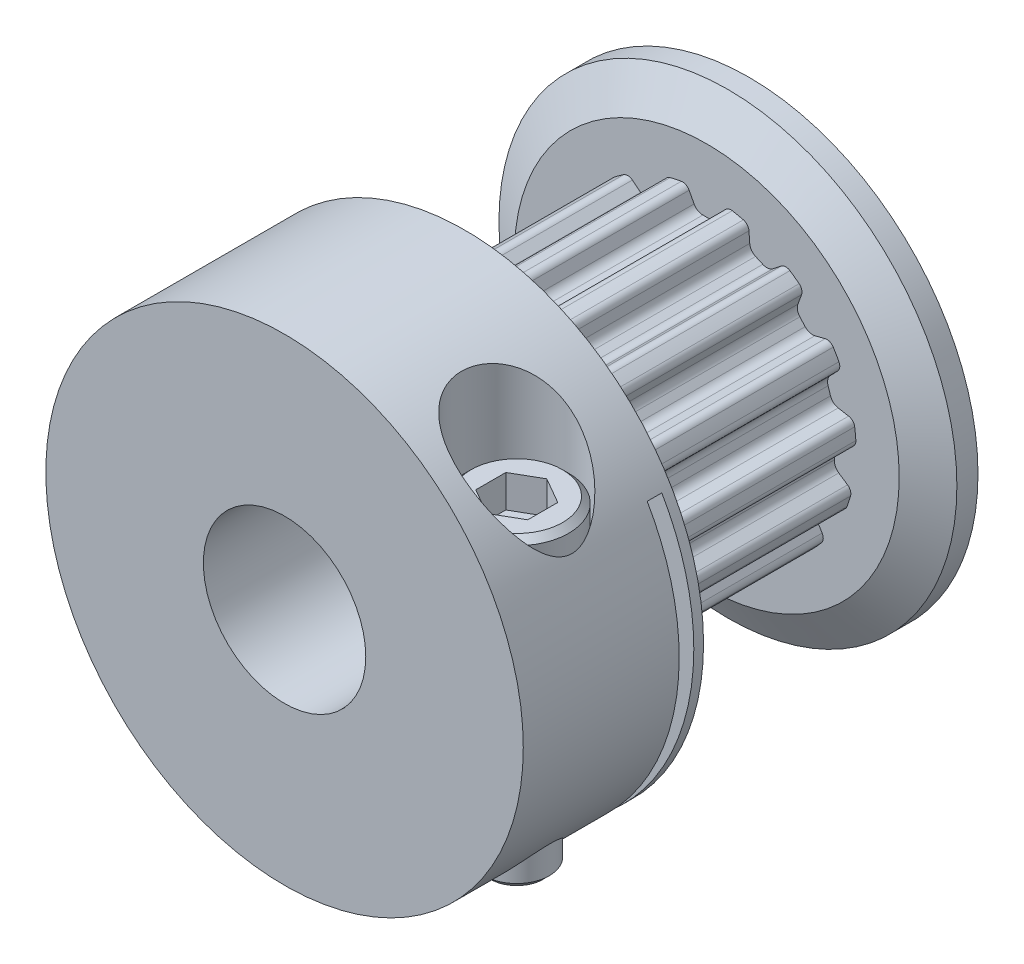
from build123d import *

# Parameters (mm, degrees)
SKETCH1_W               = 6
SKETCH1_H               = 4.85
SKETCH2_W               = 0.45
SKETCH2_H               = 4.85
CUT_REVOLVE1_ANGLE      = 180
CUT_EXTRUDE1_DEPTH      = 1
EXTRUDE1_START          = 7
SKETCH7_R               = 4.6
SKETCH7_R_2             = 2.5
EXTRUDE1_DEPTH          = 7
CUT_EXTRUDE2_START      = -8.3
CUT_EXTRUDE2_DEPTH      = 8.3
CIRPATTERN1_COUNT       = 15
SKETCH11_R              = 4.14
SKETCH11_R_2            = 2.5
EXTRUDE2_DEPTH          = 0.65
SKETCH12_R              = 3.5754
SKETCH12_R_2            = 3.5246
CUT_EXTRUDE_THIN1_DEPTH = 0.0508


with BuildPart() as part:
    # Sketch1 → Revolve1 (revolve)
    with BuildSketch(Plane(origin=(0, 0, 0), x_dir=(0, 0, -1), z_dir=(1, 0, 0)), mode=Mode.PRIVATE) as revolve1_sk:
        with Locations((-3, 4.925)):
            Rectangle(SKETCH1_W, SKETCH1_H)
    revolve(revolve1_sk.sketch.rotate(Axis((0, 0, 6.3), (0, 0, -1)), 90), axis=Axis((0, 0, 6.3), (0, 0, -1)))

    # Sketch2 → Cut-Revolve1 (revolve, cut)
    with BuildSketch(Plane(origin=(0, 0, 0), x_dir=(0, 0, -1), z_dir=(-0.49999999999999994, 0.8660254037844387, 0))):
        with Locations((-0.975, 4.925)):
            Rectangle(SKETCH2_W, SKETCH2_H)
    revolve(axis=Axis((0, 0, 1.2225), (0, 0, 1)), revolution_arc=CUT_REVOLVE1_ANGLE, mode=Mode.SUBTRACT)

    # Sketch4 → Cut-Revolve2 (revolve, cut)
    with BuildSketch(Plane.XY.offset(3.6), mode=Mode.PRIVATE) as cut_revolve2_sk:
        Polygon((3.05, 6.687301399), (3.05, 2.205), (3.74, 2.205), (3.74, -6.327313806), (4.75, -6.327313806), (4.75, 6.687301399), align=None)
    revolve(cut_revolve2_sk.sketch.rotate(Axis((4.75, -6.978044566, 3.6), (0, 1, 0)), 90), axis=Axis((4.75, -6.978044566, 3.6), (0, 1, 0)), mode=Mode.SUBTRACT)

    # Sketch5 → Revolve2 (revolve)
    with BuildSketch(Plane(origin=(4.75, 0, 3.6), x_dir=(1, 0, 0), z_dir=(0, 0, 1)), mode=Mode.PRIVATE) as revolve2_sk:
        Polygon((1.6, 4.0145), (1.6, 2.205), (1, 2.205), (1, -5.418421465), (0.8095, -5.608921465), (0, -5.608921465), (0, 4.205), (1.4095, 4.205), align=None)
    revolve(revolve2_sk.sketch.rotate(Axis((4.75, -6.099617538, 3.6), (0, 1, 0)), 90), axis=Axis((4.75, -6.099617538, 3.6), (0, 1, 0)))

    # Sketch6 → Cut-Extrude1 (cut)
    with BuildSketch(Plane(origin=(0, 4.205, 0), x_dir=(-1, 0, 0), z_dir=(0, 1, 0))):
        Polygon((-4.75, 2.676239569), (-3.95, 3.138119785), (-3.95, 4.061880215), (-4.75, 4.523760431), (-5.55, 4.061880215), (-5.55, 3.138119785), align=None)
    extrude(amount=-CUT_EXTRUDE1_DEPTH, mode=Mode.SUBTRACT)

    # Sketch7 → Extrude1 (add)
    with BuildSketch(Plane(origin=(0, 0, 0), x_dir=(-1, 0, 0), z_dir=(0, 0, -1)).offset(EXTRUDE1_START)):
        with Locations(Location((0, 0, 0), (0, 0, 180))):
            Circle(SKETCH7_R)
        with Locations(Location((0, 0, 0), (0, 0, 180))):
            Circle(SKETCH7_R_2, mode=Mode.SUBTRACT)
    extrude(amount=-EXTRUDE1_DEPTH)

    # Sketch8 → Cut-Extrude2 (cut)
    with BuildSketch(Plane(origin=(0, 0, 0), x_dir=(0.913545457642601, -0.40673664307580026, 0), z_dir=(0, 0, 1)).offset(CUT_EXTRUDE2_START)):
        with BuildLine():
            Line((0.121657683, 3.965), (-0.121657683, 3.965))
            ThreePointArc((-0.121657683, 3.965), (-0.278641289, 4.008535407), (-0.39078011, 4.126705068))
            Line((-0.39078011, 4.126705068), (-0.543880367, 4.414644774))
            ThreePointArc((-0.543880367, 4.414644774), (-0.645191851, 4.512632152), (-0.784719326, 4.532572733))
            ThreePointArc((-0.784719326, 4.532572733), (0, 4.6), (0.784719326, 4.532572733))
            ThreePointArc((0.784719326, 4.532572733), (0.645191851, 4.512632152), (0.543880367, 4.414644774))
            Line((0.543880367, 4.414644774), (0.39078011, 4.126705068))
            ThreePointArc((0.39078011, 4.126705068), (0.278641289, 4.008535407), (0.121657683, 3.965))
        make_face()
    cut_extrude2 = extrude(amount=CUT_EXTRUDE2_DEPTH, mode=Mode.SUBTRACT)

    # CirPattern1: Cut-Extrude2 ×15 about axis
    cirpattern1_axis = Axis((0, 0, 0), (0, 0, 1))
    for i in range(1, CIRPATTERN1_COUNT):
        add(cut_extrude2.rotate(cirpattern1_axis, i * 360 / CIRPATTERN1_COUNT), mode=Mode.SUBTRACT)

    # Sketch9 → Revolve3 (revolve)
    with BuildSketch(Plane(origin=(0, 0, 0), x_dir=(0, 0, -1), z_dir=(1, 0, 0)), mode=Mode.PRIVATE) as revolve3_sk:
        Polygon((7, 2.5), (7, 5.924166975), (7.65, 7.05), (8.3, 7.05), (7.65, 5.924166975), (7.65, 2.5), align=None)
    revolve(revolve3_sk.sketch.rotate(Axis((0, 0, 0.415), (0, 0, -1)), 90), axis=Axis((0, 0, 0.415), (0, 0, -1)))

    # Sketch10 → Cut-Revolve3 (revolve, cut)
    with BuildSketch(Plane(origin=(0, 0, 0), x_dir=(0, 0, -1), z_dir=(1, 0, 0)), mode=Mode.PRIVATE) as cut_revolve3_sk:
        Polygon((0, 5.924166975), (-0.45, 7.35), (0, 7.35), align=None)
    revolve(cut_revolve3_sk.sketch.rotate(Axis((0, 0, 0.8225), (0, 0, -1)), 90), axis=Axis((0, 0, 0.8225), (0, 0, -1)), mode=Mode.SUBTRACT)

    # Sketch11 → Extrude2 (add)
    with BuildSketch(Plane(origin=(0, 0, -7.65), x_dir=(-1, 0, 0), z_dir=(0, 0, -1))):
        with Locations(Location((0, 0, 0), (0, 0, 180))):
            Circle(SKETCH11_R)
        with Locations(Location((0, 0, 0), (0, 0, 180))):
            Circle(SKETCH11_R_2, mode=Mode.SUBTRACT)
    extrude(amount=EXTRUDE2_DEPTH)

    # Sketch12 → Cut-Extrude-Thin1 (cut)
    with BuildSketch(Plane(origin=(0, 0, -8.3), x_dir=(-1, 0, 0), z_dir=(0, 0, -1))):
        Circle(SKETCH12_R)
        Circle(SKETCH12_R_2, mode=Mode.SUBTRACT)
    extrude(amount=-CUT_EXTRUDE_THIN1_DEPTH, mode=Mode.SUBTRACT)


solid = part.part
